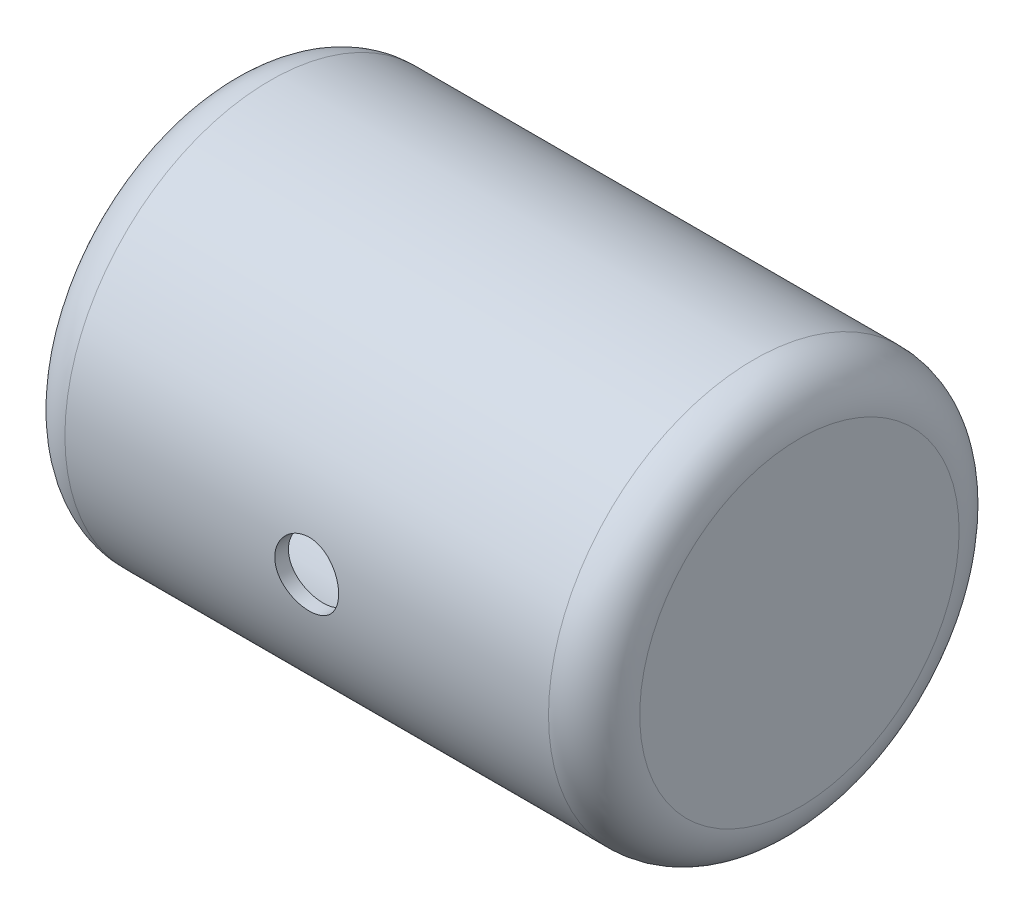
from build123d import *

# Parameters (mm, degrees)
P_IDAT_VYSUNUT_M1_DEPTH       = 63
P_IDAT_VYSUNUT_M1_DEPTH_BACK  = 63
SKICA1_R                      = 45
ZAOBLIT2_R                    = 10
ODEBRAT_VYSUNUT_M1_DEPTH      = 60
ODEBRAT_VYSUNUT_M1_DEPTH_BACK = 60
SKICA2_R                      = 42
ZAOBLIT3_R                    = 7
SKICA3_R                      = 7
ODEBRAT_VYSUNUT_M2_DEPTH      = 60
SKICA4_R                      = 8
ODEBRAT_VYSUNUT_M3_DEPTH      = 60


with BuildPart() as part:
    # Skica1 → P_idat vysunut_m1 (new, two sides: drawn at the far end of the back side and taken through both)
    with BuildSketch(Plane(origin=(0, 0, 0), x_dir=(0, 0, -1), z_dir=(1, 0, 0)).offset(-P_IDAT_VYSUNUT_M1_DEPTH_BACK)):
        Circle(SKICA1_R)
    extrude(amount=P_IDAT_VYSUNUT_M1_DEPTH + P_IDAT_VYSUNUT_M1_DEPTH_BACK)

    # Zaoblit2
    zaoblit2_edges = [part.edges().sort_by_distance(p)[0] for p in [
        (-63, 0, 45),
        (63, 0, 45),
    ]]
    fillet(zaoblit2_edges, radius=ZAOBLIT2_R)

    # Skica2 → Odebrat vysunut_m1 (cut, two sides: drawn at the far end of the back side and taken through both)
    with BuildSketch(Plane(origin=(0, 0, 0), x_dir=(0, 0, -1), z_dir=(1, 0, 0)).offset(-ODEBRAT_VYSUNUT_M1_DEPTH_BACK)):
        Circle(SKICA2_R)
    extrude(amount=ODEBRAT_VYSUNUT_M1_DEPTH + ODEBRAT_VYSUNUT_M1_DEPTH_BACK, mode=Mode.SUBTRACT)

    # Zaoblit3
    zaoblit3_edges = [part.edges().sort_by_distance(p)[0] for p in [
        (60, 0, 42),
        (-60, 0, 42),
    ]]
    fillet(zaoblit3_edges, radius=ZAOBLIT3_R)

    # Skica3 → Odebrat vysunut_m2 (cut)
    with BuildSketch(Plane.XY):
        with Locations(Location((0, 0, 0), (0, 0, 180))):
            Circle(SKICA3_R)
    extrude(amount=ODEBRAT_VYSUNUT_M2_DEPTH, mode=Mode.SUBTRACT)

    # Skica4 → Odebrat vysunut_m3 (cut)
    with BuildSketch(Plane(origin=(0, 0, 0), x_dir=(1, 0, 0), z_dir=(0, 1, 0))):
        with Locations(Location((0, 0, 0), (0, 0, 270))):
            Circle(SKICA4_R)
    extrude(amount=-ODEBRAT_VYSUNUT_M3_DEPTH, mode=Mode.SUBTRACT)


solid = part.part
